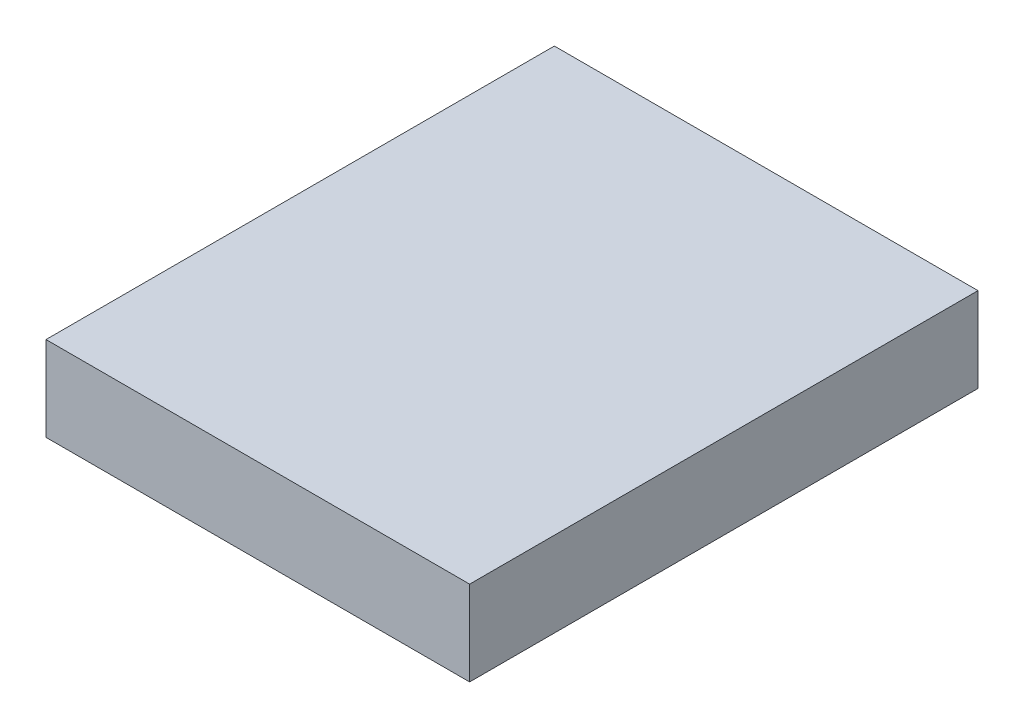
ISO-10303-21;
HEADER;
FILE_DESCRIPTION(('STEP AP214'),'2;1');
FILE_NAME('part.step','',(''),(''),'','','');
FILE_SCHEMA(('AUTOMOTIVE_DESIGN { 1 0 10303 214 1 1 1 1 }'));
ENDSEC;
DATA;
#1=APPLICATION_CONTEXT('core data for automotive mechanical design processes');
#2=APPLICATION_PROTOCOL_DEFINITION('international standard','automotive_design',2000,#1);
#3=PRODUCT_CONTEXT('',#1,'mechanical');
#4=PRODUCT('Part','Part','',(#3));
#5=PRODUCT_RELATED_PRODUCT_CATEGORY('part','',(#4));
#6=PRODUCT_DEFINITION_FORMATION('','',#4);
#7=PRODUCT_DEFINITION_CONTEXT('part definition',#1,'design');
#8=PRODUCT_DEFINITION('design','',#6,#7);
#9=PRODUCT_DEFINITION_SHAPE('','',#8);
#10=(LENGTH_UNIT() NAMED_UNIT(*) SI_UNIT(.MILLI.,.METRE.));
#11=(NAMED_UNIT(*) PLANE_ANGLE_UNIT() SI_UNIT($,.RADIAN.));
#12=(NAMED_UNIT(*) SI_UNIT($,.STERADIAN.) SOLID_ANGLE_UNIT());
#13=UNCERTAINTY_MEASURE_WITH_UNIT(LENGTH_MEASURE(1.E-05),#10,'distance_accuracy_value','');
#14=(GEOMETRIC_REPRESENTATION_CONTEXT(3) GLOBAL_UNCERTAINTY_ASSIGNED_CONTEXT((#13)) GLOBAL_UNIT_ASSIGNED_CONTEXT((#10,
#11,#12)) REPRESENTATION_CONTEXT('',''));
#15=CARTESIAN_POINT('',(0.,0.,0.));
#16=DIRECTION('',(0.,0.,1.));
#17=DIRECTION('',(1.,0.,0.));
#18=AXIS2_PLACEMENT_3D('',#15,#16,#17);
#19=CARTESIAN_POINT('',(-127.,50.8,-152.4));
#20=DIRECTION('',(1.,0.,0.));
#21=DIRECTION('',(0.,0.,-1.));
#22=AXIS2_PLACEMENT_3D('',#19,#20,#21);
#23=PLANE('',#22);
#24=DIRECTION('',(0.,0.,1.));
#25=VECTOR('',#24,1.);
#26=CARTESIAN_POINT('',(-127.,0.,-152.4));
#27=LINE('',#26,#25);
#28=CARTESIAN_POINT('',(-127.,0.,-152.4));
#29=VERTEX_POINT('',#28);
#30=CARTESIAN_POINT('',(-127.,0.,152.4));
#31=VERTEX_POINT('',#30);
#32=EDGE_CURVE('E97',#29,#31,#27,.T.);
#33=ORIENTED_EDGE('',*,*,#32,.T.);
#34=DIRECTION('',(0.,-1.,0.));
#35=VECTOR('',#34,1.);
#36=CARTESIAN_POINT('',(-127.,50.8,152.4));
#37=LINE('',#36,#35);
#38=CARTESIAN_POINT('',(-127.,50.8,152.4));
#39=VERTEX_POINT('',#38);
#40=EDGE_CURVE('E11',#39,#31,#37,.T.);
#41=ORIENTED_EDGE('',*,*,#40,.F.);
#42=DIRECTION('',(0.,0.,1.));
#43=VECTOR('',#42,1.);
#44=CARTESIAN_POINT('',(-127.,50.8,-152.4));
#45=LINE('',#44,#43);
#46=CARTESIAN_POINT('',(-127.,50.8,-152.4));
#47=VERTEX_POINT('',#46);
#48=EDGE_CURVE('E85',#47,#39,#45,.T.);
#49=ORIENTED_EDGE('',*,*,#48,.F.);
#50=DIRECTION('',(0.,-1.,0.));
#51=VECTOR('',#50,1.);
#52=CARTESIAN_POINT('',(-127.,50.8,-152.4));
#53=LINE('',#52,#51);
#54=EDGE_CURVE('E93',#47,#29,#53,.T.);
#55=ORIENTED_EDGE('',*,*,#54,.T.);
#56=EDGE_LOOP('',(#33,#41,#49,#55));
#57=FACE_BOUND('',#56,.T.);
#58=ADVANCED_FACE('F34',(#57),#23,.F.);
#59=CARTESIAN_POINT('',(-127.,50.8,152.4));
#60=DIRECTION('',(0.,0.,-1.));
#61=DIRECTION('',(-1.,0.,0.));
#62=AXIS2_PLACEMENT_3D('',#59,#60,#61);
#63=PLANE('',#62);
#64=DIRECTION('',(1.,0.,0.));
#65=VECTOR('',#64,1.);
#66=CARTESIAN_POINT('',(-127.,0.,152.4));
#67=LINE('',#66,#65);
#68=CARTESIAN_POINT('',(127.,0.,152.4));
#69=VERTEX_POINT('',#68);
#70=EDGE_CURVE('E89',#31,#69,#67,.T.);
#71=ORIENTED_EDGE('',*,*,#70,.T.);
#72=DIRECTION('',(0.,-1.,0.));
#73=VECTOR('',#72,1.);
#74=CARTESIAN_POINT('',(127.,50.8,152.4));
#75=LINE('',#74,#73);
#76=CARTESIAN_POINT('',(127.,50.8,152.4));
#77=VERTEX_POINT('',#76);
#78=EDGE_CURVE('E42',#77,#69,#75,.T.);
#79=ORIENTED_EDGE('',*,*,#78,.F.);
#80=DIRECTION('',(1.,0.,0.));
#81=VECTOR('',#80,1.);
#82=CARTESIAN_POINT('',(-127.,50.8,152.4));
#83=LINE('',#82,#81);
#84=EDGE_CURVE('E80',#39,#77,#83,.T.);
#85=ORIENTED_EDGE('',*,*,#84,.F.);
#86=ORIENTED_EDGE('',*,*,#40,.T.);
#87=EDGE_LOOP('',(#71,#79,#85,#86));
#88=FACE_BOUND('',#87,.T.);
#89=ADVANCED_FACE('F88',(#88),#63,.F.);
#90=CARTESIAN_POINT('',(127.,50.8,-152.4));
#91=DIRECTION('',(-1.,0.,0.));
#92=DIRECTION('',(0.,0.,1.));
#93=AXIS2_PLACEMENT_3D('',#90,#91,#92);
#94=PLANE('',#93);
#95=DIRECTION('',(0.,0.,-1.));
#96=VECTOR('',#95,1.);
#97=CARTESIAN_POINT('',(127.,0.,-152.4));
#98=LINE('',#97,#96);
#99=CARTESIAN_POINT('',(127.,0.,-152.4));
#100=VERTEX_POINT('',#99);
#101=EDGE_CURVE('E67',#69,#100,#98,.T.);
#102=ORIENTED_EDGE('',*,*,#101,.T.);
#103=DIRECTION('',(0.,-1.,0.));
#104=VECTOR('',#103,1.);
#105=CARTESIAN_POINT('',(127.,50.8,-152.4));
#106=LINE('',#105,#104);
#107=CARTESIAN_POINT('',(127.,50.8,-152.4));
#108=VERTEX_POINT('',#107);
#109=EDGE_CURVE('E90',#108,#100,#106,.T.);
#110=ORIENTED_EDGE('',*,*,#109,.F.);
#111=DIRECTION('',(0.,0.,-1.));
#112=VECTOR('',#111,1.);
#113=CARTESIAN_POINT('',(127.,50.8,-152.4));
#114=LINE('',#113,#112);
#115=EDGE_CURVE('E83',#77,#108,#114,.T.);
#116=ORIENTED_EDGE('',*,*,#115,.F.);
#117=ORIENTED_EDGE('',*,*,#78,.T.);
#118=EDGE_LOOP('',(#102,#110,#116,#117));
#119=FACE_BOUND('',#118,.T.);
#120=ADVANCED_FACE('F91',(#119),#94,.F.);
#121=CARTESIAN_POINT('',(-127.,50.8,-152.4));
#122=DIRECTION('',(0.,0.,1.));
#123=DIRECTION('',(1.,0.,0.));
#124=AXIS2_PLACEMENT_3D('',#121,#122,#123);
#125=PLANE('',#124);
#126=DIRECTION('',(-1.,0.,0.));
#127=VECTOR('',#126,1.);
#128=CARTESIAN_POINT('',(-127.,0.,-152.4));
#129=LINE('',#128,#127);
#130=EDGE_CURVE('E73',#100,#29,#129,.T.);
#131=ORIENTED_EDGE('',*,*,#130,.T.);
#132=ORIENTED_EDGE('',*,*,#54,.F.);
#133=DIRECTION('',(-1.,0.,0.));
#134=VECTOR('',#133,1.);
#135=CARTESIAN_POINT('',(-127.,50.8,-152.4));
#136=LINE('',#135,#134);
#137=EDGE_CURVE('E50',#108,#47,#136,.T.);
#138=ORIENTED_EDGE('',*,*,#137,.F.);
#139=ORIENTED_EDGE('',*,*,#109,.T.);
#140=EDGE_LOOP('',(#131,#132,#138,#139));
#141=FACE_BOUND('',#140,.T.);
#142=ADVANCED_FACE('F104',(#141),#125,.F.);
#143=CARTESIAN_POINT('',(-127.,50.8,152.4));
#144=DIRECTION('',(0.,1.,0.));
#145=DIRECTION('',(0.,0.,1.));
#146=AXIS2_PLACEMENT_3D('',#143,#144,#145);
#147=PLANE('',#146);
#148=ORIENTED_EDGE('',*,*,#48,.T.);
#149=ORIENTED_EDGE('',*,*,#84,.T.);
#150=ORIENTED_EDGE('',*,*,#115,.T.);
#151=ORIENTED_EDGE('',*,*,#137,.T.);
#152=EDGE_LOOP('',(#148,#149,#150,#151));
#153=FACE_BOUND('',#152,.T.);
#154=ADVANCED_FACE('F81',(#153),#147,.T.);
#155=CARTESIAN_POINT('',(-127.,0.,152.4));
#156=DIRECTION('',(0.,1.,0.));
#157=DIRECTION('',(0.,0.,1.));
#158=AXIS2_PLACEMENT_3D('',#155,#156,#157);
#159=PLANE('',#158);
#160=ORIENTED_EDGE('',*,*,#32,.F.);
#161=ORIENTED_EDGE('',*,*,#130,.F.);
#162=ORIENTED_EDGE('',*,*,#101,.F.);
#163=ORIENTED_EDGE('',*,*,#70,.F.);
#164=EDGE_LOOP('',(#160,#161,#162,#163));
#165=FACE_BOUND('',#164,.T.);
#166=ADVANCED_FACE('F107',(#165),#159,.F.);
#167=CLOSED_SHELL('',(#58,#89,#120,#142,#154,#166));
#168=MANIFOLD_SOLID_BREP('B2',#167);
#169=ADVANCED_BREP_SHAPE_REPRESENTATION('',(#18,#168),#14);
#170=SHAPE_DEFINITION_REPRESENTATION(#9,#169);
ENDSEC;
END-ISO-10303-21;
